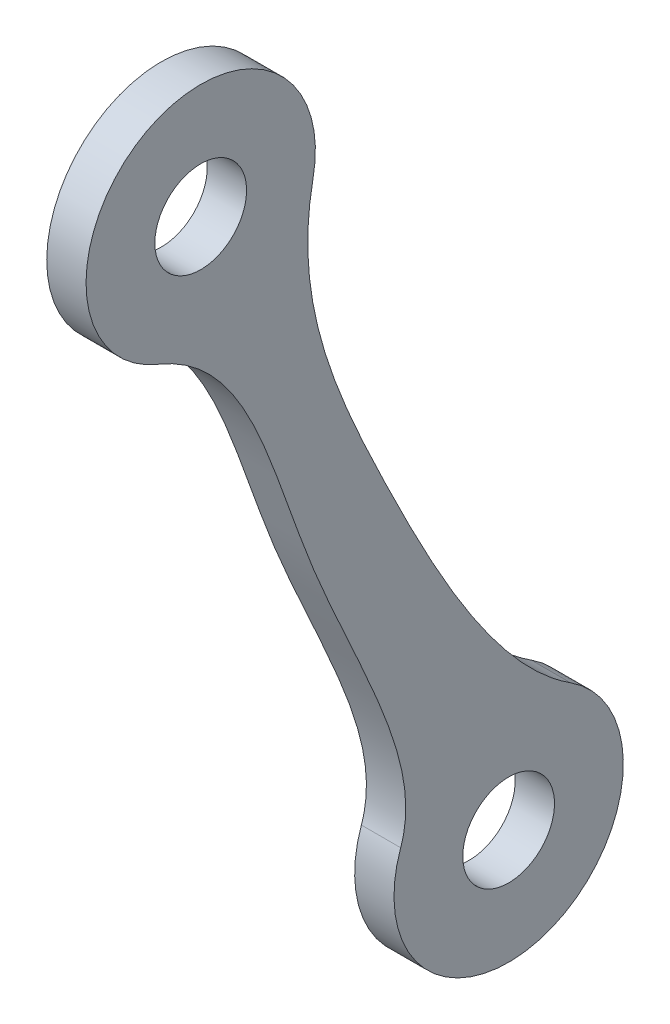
ISO-10303-21;
HEADER;
FILE_DESCRIPTION(('STEP AP214'),'2;1');
FILE_NAME('part.step','',(''),(''),'','','');
FILE_SCHEMA(('AUTOMOTIVE_DESIGN { 1 0 10303 214 1 1 1 1 }'));
ENDSEC;
DATA;
#1=APPLICATION_CONTEXT('core data for automotive mechanical design processes');
#2=APPLICATION_PROTOCOL_DEFINITION('international standard','automotive_design',2000,#1);
#3=PRODUCT_CONTEXT('',#1,'mechanical');
#4=PRODUCT('Part','Part','',(#3));
#5=PRODUCT_RELATED_PRODUCT_CATEGORY('part','',(#4));
#6=PRODUCT_DEFINITION_FORMATION('','',#4);
#7=PRODUCT_DEFINITION_CONTEXT('part definition',#1,'design');
#8=PRODUCT_DEFINITION('design','',#6,#7);
#9=PRODUCT_DEFINITION_SHAPE('','',#8);
#10=(LENGTH_UNIT() NAMED_UNIT(*) SI_UNIT(.MILLI.,.METRE.));
#11=(NAMED_UNIT(*) PLANE_ANGLE_UNIT() SI_UNIT($,.RADIAN.));
#12=(NAMED_UNIT(*) SI_UNIT($,.STERADIAN.) SOLID_ANGLE_UNIT());
#13=UNCERTAINTY_MEASURE_WITH_UNIT(LENGTH_MEASURE(1.E-05),#10,'distance_accuracy_value','');
#14=(GEOMETRIC_REPRESENTATION_CONTEXT(3) GLOBAL_UNCERTAINTY_ASSIGNED_CONTEXT((#13)) GLOBAL_UNIT_ASSIGNED_CONTEXT((#10,
#11,#12)) REPRESENTATION_CONTEXT('',''));
#15=CARTESIAN_POINT('',(0.,0.,0.));
#16=DIRECTION('',(0.,0.,1.));
#17=DIRECTION('',(1.,0.,0.));
#18=AXIS2_PLACEMENT_3D('',#15,#16,#17);
#19=CARTESIAN_POINT('',(-1.09279178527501,-43.8655895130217,18.2815722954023));
#20=DIRECTION('',(1.,0.,0.));
#21=DIRECTION('',(0.,0.,-1.));
#22=AXIS2_PLACEMENT_3D('',#19,#20,#21);
#23=CYLINDRICAL_SURFACE('',#22,8.75);
#24=DIRECTION('',(-1.,0.,0.));
#25=VECTOR('',#24,1.);
#26=CARTESIAN_POINT('',(-1.09279178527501,-36.5033221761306,13.5529869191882));
#27=LINE('',#26,#25);
#28=CARTESIAN_POINT('',(1.90720821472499,-36.5033221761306,13.5529869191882));
#29=VERTEX_POINT('',#28);
#30=CARTESIAN_POINT('',(-1.09279178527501,-36.5033221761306,13.5529869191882));
#31=VERTEX_POINT('',#30);
#32=EDGE_CURVE('E11',#29,#31,#27,.T.);
#33=ORIENTED_EDGE('',*,*,#32,.F.);
#34=CARTESIAN_POINT('',(1.90720821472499,-43.8655895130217,18.2815722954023));
#35=DIRECTION('',(1.,0.,0.));
#36=DIRECTION('',(0.,0.,-1.));
#37=AXIS2_PLACEMENT_3D('',#34,#35,#36);
#38=CIRCLE('',#37,8.75);
#39=CARTESIAN_POINT('',(1.90720821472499,-40.9198751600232,26.5208238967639));
#40=VERTEX_POINT('',#39);
#41=EDGE_CURVE('E94',#40,#29,#38,.T.);
#42=ORIENTED_EDGE('',*,*,#41,.F.);
#43=DIRECTION('',(-1.,0.,0.));
#44=VECTOR('',#43,1.);
#45=CARTESIAN_POINT('',(-1.09279178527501,-40.9198751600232,26.5208238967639));
#46=LINE('',#45,#44);
#47=CARTESIAN_POINT('',(-1.09279178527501,-40.9198751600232,26.5208238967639));
#48=VERTEX_POINT('',#47);
#49=EDGE_CURVE('E50',#40,#48,#46,.T.);
#50=ORIENTED_EDGE('',*,*,#49,.T.);
#51=CARTESIAN_POINT('',(-1.09279178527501,-43.8655895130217,18.2815722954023));
#52=DIRECTION('',(1.,0.,0.));
#53=DIRECTION('',(0.,0.,-1.));
#54=AXIS2_PLACEMENT_3D('',#51,#52,#53);
#55=CIRCLE('',#54,8.75);
#56=EDGE_CURVE('E124',#48,#31,#55,.T.);
#57=ORIENTED_EDGE('',*,*,#56,.T.);
#58=EDGE_LOOP('',(#33,#42,#50,#57));
#59=FACE_BOUND('',#58,.T.);
#60=ADVANCED_FACE('F39',(#59),#23,.T.);
#61=CARTESIAN_POINT('',(-1.09279178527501,0.291769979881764,45.0468200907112));
#62=CARTESIAN_POINT('',(-1.09279178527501,-2.51937369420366,38.0643560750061));
#63=CARTESIAN_POINT('',(-1.09279178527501,-19.1590927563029,35.0117884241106));
#64=CARTESIAN_POINT('',(-1.09279178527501,-35.7564937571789,24.6748010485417));
#65=CARTESIAN_POINT('',(-1.09279178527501,-40.9198751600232,26.5208238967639));
#66=B_SPLINE_CURVE_WITH_KNOTS('',3,(#61,#62,#63,#64,#65),.UNSPECIFIED.,.F.,.F.,(4,1,4),(0.,
0.500014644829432,1.),.UNSPECIFIED.);
#67=DIRECTION('',(1.,0.,0.));
#68=VECTOR('',#67,1.);
#69=SURFACE_OF_LINEAR_EXTRUSION('',#66,#68);
#70=ORIENTED_EDGE('',*,*,#49,.F.);
#71=CARTESIAN_POINT('',(1.90720821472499,0.291769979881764,45.0468200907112));
#72=CARTESIAN_POINT('',(1.90720821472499,-2.51937369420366,38.0643560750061));
#73=CARTESIAN_POINT('',(1.90720821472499,-19.1590927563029,35.0117884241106));
#74=CARTESIAN_POINT('',(1.90720821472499,-35.7564937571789,24.6748010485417));
#75=CARTESIAN_POINT('',(1.90720821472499,-40.9198751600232,26.5208238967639));
#76=B_SPLINE_CURVE_WITH_KNOTS('',3,(#71,#72,#73,#74,#75),.UNSPECIFIED.,.F.,.F.,(4,1,4),(0.,
0.500014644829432,1.),.UNSPECIFIED.);
#77=CARTESIAN_POINT('',(1.90720821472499,0.291769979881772,45.0468200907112));
#78=VERTEX_POINT('',#77);
#79=EDGE_CURVE('E108',#78,#40,#76,.T.);
#80=ORIENTED_EDGE('',*,*,#79,.F.);
#81=DIRECTION('',(-1.,0.,0.));
#82=VECTOR('',#81,1.);
#83=CARTESIAN_POINT('',(-1.09279178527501,0.291769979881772,45.0468200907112));
#84=LINE('',#83,#82);
#85=CARTESIAN_POINT('',(-1.09279178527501,0.291769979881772,45.0468200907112));
#86=VERTEX_POINT('',#85);
#87=EDGE_CURVE('E58',#78,#86,#84,.T.);
#88=ORIENTED_EDGE('',*,*,#87,.T.);
#89=EDGE_CURVE('E88',#86,#48,#66,.T.);
#90=ORIENTED_EDGE('',*,*,#89,.T.);
#91=EDGE_LOOP('',(#70,#80,#88,#90));
#92=FACE_BOUND('',#91,.T.);
#93=ADVANCED_FACE('F128',(#92),#69,.T.);
#94=CARTESIAN_POINT('',(-1.09279178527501,8.40864198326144,41.7789631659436));
#95=DIRECTION('',(1.,0.,0.));
#96=DIRECTION('',(0.,0.,-1.));
#97=AXIS2_PLACEMENT_3D('',#94,#95,#96);
#98=CYLINDRICAL_SURFACE('',#97,8.74999999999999);
#99=ORIENTED_EDGE('',*,*,#87,.F.);
#100=CARTESIAN_POINT('',(1.90720821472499,8.40864198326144,41.7789631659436));
#101=DIRECTION('',(1.,0.,0.));
#102=DIRECTION('',(0.,0.,-1.));
#103=AXIS2_PLACEMENT_3D('',#100,#101,#102);
#104=CIRCLE('',#103,8.74999999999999);
#105=CARTESIAN_POINT('',(1.90720821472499,6.64787767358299,33.2079533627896));
#106=VERTEX_POINT('',#105);
#107=EDGE_CURVE('E93',#106,#78,#104,.T.);
#108=ORIENTED_EDGE('',*,*,#107,.F.);
#109=DIRECTION('',(-1.,0.,0.));
#110=VECTOR('',#109,1.);
#111=CARTESIAN_POINT('',(-1.09279178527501,6.64787767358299,33.2079533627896));
#112=LINE('',#111,#110);
#113=CARTESIAN_POINT('',(-1.09279178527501,6.64787767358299,33.2079533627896));
#114=VERTEX_POINT('',#113);
#115=EDGE_CURVE('E44',#106,#114,#112,.T.);
#116=ORIENTED_EDGE('',*,*,#115,.T.);
#117=CARTESIAN_POINT('',(-1.09279178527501,8.40864198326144,41.7789631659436));
#118=DIRECTION('',(1.,0.,0.));
#119=DIRECTION('',(0.,0.,-1.));
#120=AXIS2_PLACEMENT_3D('',#117,#118,#119);
#121=CIRCLE('',#120,8.74999999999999);
#122=EDGE_CURVE('E112',#114,#86,#121,.T.);
#123=ORIENTED_EDGE('',*,*,#122,.T.);
#124=EDGE_LOOP('',(#99,#108,#116,#123));
#125=FACE_BOUND('',#124,.T.);
#126=ADVANCED_FACE('F96',(#125),#98,.T.);
#127=CARTESIAN_POINT('',(-1.09279178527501,6.64787767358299,33.2079533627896));
#128=CARTESIAN_POINT('',(-1.09279178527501,-0.930964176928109,34.7648940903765));
#129=CARTESIAN_POINT('',(-1.09279178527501,-16.149748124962,28.105004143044));
#130=CARTESIAN_POINT('',(-1.09279178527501,-32.8206319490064,19.2868264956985));
#131=CARTESIAN_POINT('',(-1.09279178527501,-36.5033221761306,13.5529869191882));
#132=B_SPLINE_CURVE_WITH_KNOTS('',3,(#127,#128,#129,#130,#131),.UNSPECIFIED.,.F.,.F.,(4,1,4),
(0.,0.478706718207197,1.),.UNSPECIFIED.);
#133=DIRECTION('',(1.,0.,0.));
#134=VECTOR('',#133,1.);
#135=SURFACE_OF_LINEAR_EXTRUSION('',#132,#134);
#136=CARTESIAN_POINT('',(1.90720821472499,6.64787767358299,33.2079533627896));
#137=CARTESIAN_POINT('',(1.90720821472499,-0.930964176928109,34.7648940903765));
#138=CARTESIAN_POINT('',(1.90720821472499,-16.149748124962,28.105004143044));
#139=CARTESIAN_POINT('',(1.90720821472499,-32.8206319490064,19.2868264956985));
#140=CARTESIAN_POINT('',(1.90720821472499,-36.5033221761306,13.5529869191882));
#141=B_SPLINE_CURVE_WITH_KNOTS('',3,(#136,#137,#138,#139,#140),.UNSPECIFIED.,.F.,.F.,(4,1,4),
(0.,0.478706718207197,1.),.UNSPECIFIED.);
#142=EDGE_CURVE('E82',#106,#29,#141,.T.);
#143=ORIENTED_EDGE('',*,*,#142,.T.);
#144=ORIENTED_EDGE('',*,*,#32,.T.);
#145=EDGE_CURVE('E84',#114,#31,#132,.T.);
#146=ORIENTED_EDGE('',*,*,#145,.F.);
#147=ORIENTED_EDGE('',*,*,#115,.F.);
#148=EDGE_LOOP('',(#143,#144,#146,#147));
#149=FACE_BOUND('',#148,.T.);
#150=ADVANCED_FACE('F41',(#149),#135,.F.);
#151=CARTESIAN_POINT('',(-1.09279178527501,8.40864198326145,-13.6377035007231));
#152=DIRECTION('',(1.,0.,0.));
#153=DIRECTION('',(0.,0.,-1.));
#154=AXIS2_PLACEMENT_3D('',#151,#152,#153);
#155=PLANE('',#154);
#156=CARTESIAN_POINT('',(-1.09279178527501,-43.8655895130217,18.2815722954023));
#157=DIRECTION('',(-1.,0.,0.));
#158=DIRECTION('',(0.,0.,1.));
#159=AXIS2_PLACEMENT_3D('',#156,#157,#158);
#160=CIRCLE('',#159,3.5);
#161=CARTESIAN_POINT('',(-1.09279178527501,-43.8655895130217,21.7815722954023));
#162=VERTEX_POINT('',#161);
#163=EDGE_CURVE('E158',#162,#162,#160,.T.);
#164=ORIENTED_EDGE('',*,*,#163,.F.);
#165=EDGE_LOOP('',(#164));
#166=FACE_BOUND('',#165,.T.);
#167=CARTESIAN_POINT('',(-1.09279178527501,8.40864198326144,41.7789631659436));
#168=DIRECTION('',(-1.,0.,0.));
#169=DIRECTION('',(0.,0.,1.));
#170=AXIS2_PLACEMENT_3D('',#167,#168,#169);
#171=CIRCLE('',#170,3.5);
#172=CARTESIAN_POINT('',(-1.09279178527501,8.40864198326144,45.2789631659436));
#173=VERTEX_POINT('',#172);
#174=EDGE_CURVE('E100',#173,#173,#171,.T.);
#175=ORIENTED_EDGE('',*,*,#174,.F.);
#176=EDGE_LOOP('',(#175));
#177=FACE_BOUND('',#176,.T.);
#178=ORIENTED_EDGE('',*,*,#122,.F.);
#179=ORIENTED_EDGE('',*,*,#145,.T.);
#180=ORIENTED_EDGE('',*,*,#56,.F.);
#181=ORIENTED_EDGE('',*,*,#89,.F.);
#182=EDGE_LOOP('',(#178,#179,#180,#181));
#183=FACE_BOUND('',#182,.T.);
#184=ADVANCED_FACE('F127',(#166,#177,#183),#155,.F.);
#185=CARTESIAN_POINT('',(1.90720821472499,8.40864198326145,-13.6377035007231));
#186=DIRECTION('',(1.,0.,0.));
#187=DIRECTION('',(0.,0.,-1.));
#188=AXIS2_PLACEMENT_3D('',#185,#186,#187);
#189=PLANE('',#188);
#190=CARTESIAN_POINT('',(1.90720821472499,-43.8655895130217,18.2815722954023));
#191=DIRECTION('',(-1.,0.,0.));
#192=DIRECTION('',(0.,0.,1.));
#193=AXIS2_PLACEMENT_3D('',#190,#191,#192);
#194=CIRCLE('',#193,3.5);
#195=CARTESIAN_POINT('',(1.90720821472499,-43.8655895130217,21.7815722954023));
#196=VERTEX_POINT('',#195);
#197=EDGE_CURVE('E155',#196,#196,#194,.T.);
#198=ORIENTED_EDGE('',*,*,#197,.T.);
#199=EDGE_LOOP('',(#198));
#200=FACE_BOUND('',#199,.T.);
#201=CARTESIAN_POINT('',(1.90720821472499,8.40864198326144,41.7789631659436));
#202=DIRECTION('',(-1.,0.,0.));
#203=DIRECTION('',(0.,0.,1.));
#204=AXIS2_PLACEMENT_3D('',#201,#202,#203);
#205=CIRCLE('',#204,3.5);
#206=CARTESIAN_POINT('',(1.90720821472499,8.40864198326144,45.2789631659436));
#207=VERTEX_POINT('',#206);
#208=EDGE_CURVE('E97',#207,#207,#205,.T.);
#209=ORIENTED_EDGE('',*,*,#208,.T.);
#210=EDGE_LOOP('',(#209));
#211=FACE_BOUND('',#210,.T.);
#212=ORIENTED_EDGE('',*,*,#107,.T.);
#213=ORIENTED_EDGE('',*,*,#79,.T.);
#214=ORIENTED_EDGE('',*,*,#41,.T.);
#215=ORIENTED_EDGE('',*,*,#142,.F.);
#216=EDGE_LOOP('',(#212,#213,#214,#215));
#217=FACE_BOUND('',#216,.T.);
#218=ADVANCED_FACE('F91',(#200,#211,#217),#189,.T.);
#219=CARTESIAN_POINT('',(1.90720821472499,8.40864198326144,41.7789631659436));
#220=DIRECTION('',(-1.,0.,0.));
#221=DIRECTION('',(0.,0.,1.));
#222=AXIS2_PLACEMENT_3D('',#219,#220,#221);
#223=CYLINDRICAL_SURFACE('',#222,3.5);
#224=ORIENTED_EDGE('',*,*,#208,.F.);
#225=EDGE_LOOP('',(#224));
#226=FACE_BOUND('',#225,.T.);
#227=ORIENTED_EDGE('',*,*,#174,.T.);
#228=EDGE_LOOP('',(#227));
#229=FACE_BOUND('',#228,.T.);
#230=ADVANCED_FACE('F139',(#226,#229),#223,.F.);
#231=CARTESIAN_POINT('',(1.90720821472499,-43.8655895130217,18.2815722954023));
#232=DIRECTION('',(-1.,0.,0.));
#233=DIRECTION('',(0.,0.,1.));
#234=AXIS2_PLACEMENT_3D('',#231,#232,#233);
#235=CYLINDRICAL_SURFACE('',#234,3.5);
#236=ORIENTED_EDGE('',*,*,#197,.F.);
#237=EDGE_LOOP('',(#236));
#238=FACE_BOUND('',#237,.T.);
#239=ORIENTED_EDGE('',*,*,#163,.T.);
#240=EDGE_LOOP('',(#239));
#241=FACE_BOUND('',#240,.T.);
#242=ADVANCED_FACE('F146',(#238,#241),#235,.F.);
#243=CLOSED_SHELL('',(#60,#93,#126,#150,#184,#218,#230,#242));
#244=MANIFOLD_SOLID_BREP('B2',#243);
#245=ADVANCED_BREP_SHAPE_REPRESENTATION('',(#18,#244),#14);
#246=SHAPE_DEFINITION_REPRESENTATION(#9,#245);
ENDSEC;
END-ISO-10303-21;
